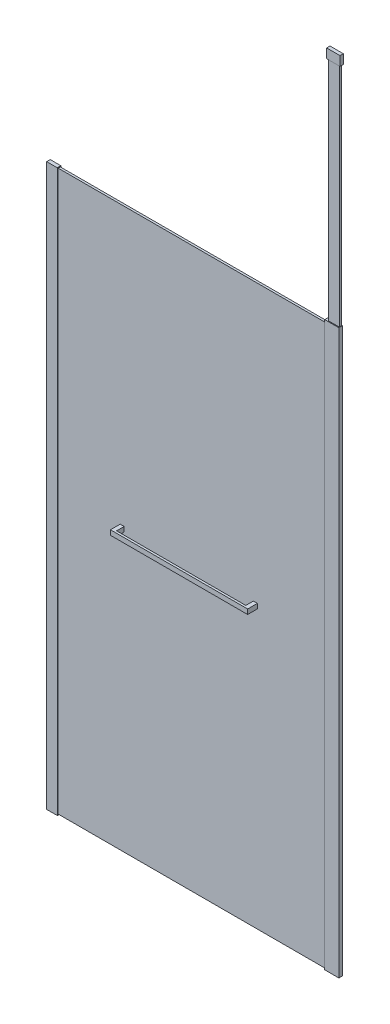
ISO-10303-21;
HEADER;
FILE_DESCRIPTION(('STEP AP214'),'2;1');
FILE_NAME('part.step','',(''),(''),'','','');
FILE_SCHEMA(('AUTOMOTIVE_DESIGN { 1 0 10303 214 1 1 1 1 }'));
ENDSEC;
DATA;
#1=APPLICATION_CONTEXT('core data for automotive mechanical design processes');
#2=APPLICATION_PROTOCOL_DEFINITION('international standard','automotive_design',2000,#1);
#3=PRODUCT_CONTEXT('',#1,'mechanical');
#4=PRODUCT('Part','Part','',(#3));
#5=PRODUCT_RELATED_PRODUCT_CATEGORY('part','',(#4));
#6=PRODUCT_DEFINITION_FORMATION('','',#4);
#7=PRODUCT_DEFINITION_CONTEXT('part definition',#1,'design');
#8=PRODUCT_DEFINITION('design','',#6,#7);
#9=PRODUCT_DEFINITION_SHAPE('','',#8);
#10=(LENGTH_UNIT() NAMED_UNIT(*) SI_UNIT(.MILLI.,.METRE.));
#11=(NAMED_UNIT(*) PLANE_ANGLE_UNIT() SI_UNIT($,.RADIAN.));
#12=(NAMED_UNIT(*) SI_UNIT($,.STERADIAN.) SOLID_ANGLE_UNIT());
#13=UNCERTAINTY_MEASURE_WITH_UNIT(LENGTH_MEASURE(1.E-05),#10,'distance_accuracy_value','');
#14=(GEOMETRIC_REPRESENTATION_CONTEXT(3) GLOBAL_UNCERTAINTY_ASSIGNED_CONTEXT((#13)) GLOBAL_UNIT_ASSIGNED_CONTEXT((#10,
#11,#12)) REPRESENTATION_CONTEXT('',''));
#15=CARTESIAN_POINT('',(0.,0.,0.));
#16=DIRECTION('',(0.,0.,1.));
#17=DIRECTION('',(1.,0.,0.));
#18=AXIS2_PLACEMENT_3D('',#15,#16,#17);
#19=CARTESIAN_POINT('',(287.5,1062.,-21.4));
#20=DIRECTION('',(1.,0.,0.));
#21=DIRECTION('',(0.,0.,-1.));
#22=AXIS2_PLACEMENT_3D('',#19,#20,#21);
#23=PLANE('',#22);
#24=DIRECTION('',(0.,1.,0.));
#25=VECTOR('',#24,1.);
#26=CARTESIAN_POINT('',(287.5,1062.,25.1));
#27=LINE('',#26,#25);
#28=CARTESIAN_POINT('',(287.5,1044.,25.1));
#29=VERTEX_POINT('',#28);
#30=CARTESIAN_POINT('',(287.5,1062.,25.1));
#31=VERTEX_POINT('',#30);
#32=EDGE_CURVE('E63',#29,#31,#27,.T.);
#33=ORIENTED_EDGE('',*,*,#32,.F.);
#34=DIRECTION('',(0.,0.,1.));
#35=VECTOR('',#34,1.);
#36=CARTESIAN_POINT('',(287.5,1044.,-21.4));
#37=LINE('',#36,#35);
#38=CARTESIAN_POINT('',(287.5,1044.,-21.4));
#39=VERTEX_POINT('',#38);
#40=EDGE_CURVE('E12',#39,#29,#37,.T.);
#41=ORIENTED_EDGE('',*,*,#40,.F.);
#42=DIRECTION('',(0.,1.,0.));
#43=VECTOR('',#42,1.);
#44=CARTESIAN_POINT('',(287.5,1062.,-21.4));
#45=LINE('',#44,#43);
#46=CARTESIAN_POINT('',(287.5,1062.,-21.4));
#47=VERTEX_POINT('',#46);
#48=EDGE_CURVE('E193',#39,#47,#45,.T.);
#49=ORIENTED_EDGE('',*,*,#48,.T.);
#50=DIRECTION('',(0.,0.,1.));
#51=VECTOR('',#50,1.);
#52=CARTESIAN_POINT('',(287.5,1062.,-21.4));
#53=LINE('',#52,#51);
#54=EDGE_CURVE('E176',#47,#31,#53,.T.);
#55=ORIENTED_EDGE('',*,*,#54,.T.);
#56=EDGE_LOOP('',(#33,#41,#49,#55));
#57=FACE_BOUND('',#56,.T.);
#58=ADVANCED_FACE('F46',(#57),#23,.T.);
#59=CARTESIAN_POINT('',(272.5,1044.,-21.4));
#60=DIRECTION('',(0.,-1.,0.));
#61=DIRECTION('',(0.,0.,-1.));
#62=AXIS2_PLACEMENT_3D('',#59,#60,#61);
#63=PLANE('',#62);
#64=ORIENTED_EDGE('',*,*,#40,.T.);
#65=DIRECTION('',(-1.,0.,0.));
#66=VECTOR('',#65,1.);
#67=CARTESIAN_POINT('',(792.197715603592,1044.,25.1));
#68=LINE('',#67,#66);
#69=CARTESIAN_POINT('',(772.5,1044.,25.1));
#70=VERTEX_POINT('',#69);
#71=EDGE_CURVE('E166',#70,#29,#68,.T.);
#72=ORIENTED_EDGE('',*,*,#71,.F.);
#73=DIRECTION('',(0.,0.,1.));
#74=VECTOR('',#73,1.);
#75=CARTESIAN_POINT('',(772.5,1044.,-21.4));
#76=LINE('',#75,#74);
#77=CARTESIAN_POINT('',(772.5,1044.,-21.4));
#78=VERTEX_POINT('',#77);
#79=EDGE_CURVE('E149',#78,#70,#76,.T.);
#80=ORIENTED_EDGE('',*,*,#79,.F.);
#81=DIRECTION('',(1.,0.,0.));
#82=VECTOR('',#81,1.);
#83=CARTESIAN_POINT('',(772.5,1044.,-21.4));
#84=LINE('',#83,#82);
#85=CARTESIAN_POINT('',(787.5,1044.,-21.4));
#86=VERTEX_POINT('',#85);
#87=EDGE_CURVE('E131',#78,#86,#84,.T.);
#88=ORIENTED_EDGE('',*,*,#87,.T.);
#89=DIRECTION('',(0.,0.,1.));
#90=VECTOR('',#89,1.);
#91=CARTESIAN_POINT('',(787.5,1044.,-21.4));
#92=LINE('',#91,#90);
#93=CARTESIAN_POINT('',(787.5,1044.,33.1));
#94=VERTEX_POINT('',#93);
#95=EDGE_CURVE('E147',#86,#94,#92,.T.);
#96=ORIENTED_EDGE('',*,*,#95,.T.);
#97=DIRECTION('',(1.,0.,0.));
#98=VECTOR('',#97,1.);
#99=CARTESIAN_POINT('',(272.5,1044.,33.1));
#100=LINE('',#99,#98);
#101=CARTESIAN_POINT('',(272.5,1044.,33.1));
#102=VERTEX_POINT('',#101);
#103=EDGE_CURVE('E135',#102,#94,#100,.T.);
#104=ORIENTED_EDGE('',*,*,#103,.F.);
#105=DIRECTION('',(0.,0.,1.));
#106=VECTOR('',#105,1.);
#107=CARTESIAN_POINT('',(272.5,1044.,-21.4));
#108=LINE('',#107,#106);
#109=CARTESIAN_POINT('',(272.5,1044.,-21.4));
#110=VERTEX_POINT('',#109);
#111=EDGE_CURVE('E55',#110,#102,#108,.T.);
#112=ORIENTED_EDGE('',*,*,#111,.F.);
#113=DIRECTION('',(1.,0.,0.));
#114=VECTOR('',#113,1.);
#115=CARTESIAN_POINT('',(272.5,1044.,-21.4));
#116=LINE('',#115,#114);
#117=EDGE_CURVE('E181',#110,#39,#116,.T.);
#118=ORIENTED_EDGE('',*,*,#117,.T.);
#119=EDGE_LOOP('',(#64,#72,#80,#88,#96,#104,#112,#118));
#120=FACE_BOUND('',#119,.T.);
#121=ADVANCED_FACE('F197',(#120),#63,.T.);
#122=CARTESIAN_POINT('',(272.5,1062.,-21.4));
#123=DIRECTION('',(-1.,0.,0.));
#124=DIRECTION('',(0.,0.,1.));
#125=AXIS2_PLACEMENT_3D('',#122,#123,#124);
#126=PLANE('',#125);
#127=ORIENTED_EDGE('',*,*,#111,.T.);
#128=DIRECTION('',(0.,-1.,0.));
#129=VECTOR('',#128,1.);
#130=CARTESIAN_POINT('',(272.5,1062.,33.1));
#131=LINE('',#130,#129);
#132=CARTESIAN_POINT('',(272.5,1062.,33.1));
#133=VERTEX_POINT('',#132);
#134=EDGE_CURVE('E121',#133,#102,#131,.T.);
#135=ORIENTED_EDGE('',*,*,#134,.F.);
#136=DIRECTION('',(0.,0.,1.));
#137=VECTOR('',#136,1.);
#138=CARTESIAN_POINT('',(272.5,1062.,-21.4));
#139=LINE('',#138,#137);
#140=CARTESIAN_POINT('',(272.5,1062.,-21.4));
#141=VERTEX_POINT('',#140);
#142=EDGE_CURVE('E116',#141,#133,#139,.T.);
#143=ORIENTED_EDGE('',*,*,#142,.F.);
#144=DIRECTION('',(0.,-1.,0.));
#145=VECTOR('',#144,1.);
#146=CARTESIAN_POINT('',(272.5,1062.,-21.4));
#147=LINE('',#146,#145);
#148=EDGE_CURVE('E186',#141,#110,#147,.T.);
#149=ORIENTED_EDGE('',*,*,#148,.T.);
#150=EDGE_LOOP('',(#127,#135,#143,#149));
#151=FACE_BOUND('',#150,.T.);
#152=ADVANCED_FACE('F218',(#151),#126,.T.);
#153=CARTESIAN_POINT('',(272.5,1062.,-21.4));
#154=DIRECTION('',(0.,1.,0.));
#155=DIRECTION('',(0.,0.,1.));
#156=AXIS2_PLACEMENT_3D('',#153,#154,#155);
#157=PLANE('',#156);
#158=ORIENTED_EDGE('',*,*,#142,.T.);
#159=DIRECTION('',(-1.,0.,0.));
#160=VECTOR('',#159,1.);
#161=CARTESIAN_POINT('',(272.5,1062.,33.1));
#162=LINE('',#161,#160);
#163=CARTESIAN_POINT('',(787.5,1062.,33.1));
#164=VERTEX_POINT('',#163);
#165=EDGE_CURVE('E109',#164,#133,#162,.T.);
#166=ORIENTED_EDGE('',*,*,#165,.F.);
#167=DIRECTION('',(0.,0.,1.));
#168=VECTOR('',#167,1.);
#169=CARTESIAN_POINT('',(787.5,1062.,-21.4));
#170=LINE('',#169,#168);
#171=CARTESIAN_POINT('',(787.5,1062.,-21.4));
#172=VERTEX_POINT('',#171);
#173=EDGE_CURVE('E113',#172,#164,#170,.T.);
#174=ORIENTED_EDGE('',*,*,#173,.F.);
#175=DIRECTION('',(-1.,0.,0.));
#176=VECTOR('',#175,1.);
#177=CARTESIAN_POINT('',(772.5,1062.,-21.4));
#178=LINE('',#177,#176);
#179=CARTESIAN_POINT('',(772.5,1062.,-21.4));
#180=VERTEX_POINT('',#179);
#181=EDGE_CURVE('E138',#172,#180,#178,.T.);
#182=ORIENTED_EDGE('',*,*,#181,.T.);
#183=DIRECTION('',(0.,0.,1.));
#184=VECTOR('',#183,1.);
#185=CARTESIAN_POINT('',(772.5,1062.,-21.4));
#186=LINE('',#185,#184);
#187=CARTESIAN_POINT('',(772.5,1062.,25.1));
#188=VERTEX_POINT('',#187);
#189=EDGE_CURVE('E130',#180,#188,#186,.T.);
#190=ORIENTED_EDGE('',*,*,#189,.T.);
#191=DIRECTION('',(-1.,0.,0.));
#192=VECTOR('',#191,1.);
#193=CARTESIAN_POINT('',(792.197715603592,1062.,25.1));
#194=LINE('',#193,#192);
#195=EDGE_CURVE('E163',#188,#31,#194,.T.);
#196=ORIENTED_EDGE('',*,*,#195,.T.);
#197=ORIENTED_EDGE('',*,*,#54,.F.);
#198=DIRECTION('',(-1.,0.,0.));
#199=VECTOR('',#198,1.);
#200=CARTESIAN_POINT('',(272.5,1062.,-21.4));
#201=LINE('',#200,#199);
#202=EDGE_CURVE('E190',#47,#141,#201,.T.);
#203=ORIENTED_EDGE('',*,*,#202,.T.);
#204=EDGE_LOOP('',(#158,#166,#174,#182,#190,#196,#197,#203));
#205=FACE_BOUND('',#204,.T.);
#206=ADVANCED_FACE('F111',(#205),#157,.T.);
#207=CARTESIAN_POINT('',(287.5,1044.,-21.4));
#208=DIRECTION('',(0.,0.,1.));
#209=DIRECTION('',(1.,0.,0.));
#210=AXIS2_PLACEMENT_3D('',#207,#208,#209);
#211=PLANE('',#210);
#212=ORIENTED_EDGE('',*,*,#48,.F.);
#213=ORIENTED_EDGE('',*,*,#117,.F.);
#214=ORIENTED_EDGE('',*,*,#148,.F.);
#215=ORIENTED_EDGE('',*,*,#202,.F.);
#216=EDGE_LOOP('',(#212,#213,#214,#215));
#217=FACE_BOUND('',#216,.T.);
#218=ADVANCED_FACE('F225',(#217),#211,.F.);
#219=CARTESIAN_POINT('',(287.5,1044.,33.1));
#220=DIRECTION('',(0.,0.,1.));
#221=DIRECTION('',(1.,0.,0.));
#222=AXIS2_PLACEMENT_3D('',#219,#220,#221);
#223=PLANE('',#222);
#224=ORIENTED_EDGE('',*,*,#103,.T.);
#225=DIRECTION('',(0.,1.,0.));
#226=VECTOR('',#225,1.);
#227=CARTESIAN_POINT('',(787.5,1062.,33.1));
#228=LINE('',#227,#226);
#229=EDGE_CURVE('E127',#94,#164,#228,.T.);
#230=ORIENTED_EDGE('',*,*,#229,.T.);
#231=ORIENTED_EDGE('',*,*,#165,.T.);
#232=ORIENTED_EDGE('',*,*,#134,.T.);
#233=EDGE_LOOP('',(#224,#230,#231,#232));
#234=FACE_BOUND('',#233,.T.);
#235=ADVANCED_FACE('F133',(#234),#223,.T.);
#236=CARTESIAN_POINT('',(792.197715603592,1062.,25.1));
#237=DIRECTION('',(0.,0.,1.));
#238=DIRECTION('',(1.,0.,0.));
#239=AXIS2_PLACEMENT_3D('',#236,#237,#238);
#240=PLANE('',#239);
#241=ORIENTED_EDGE('',*,*,#195,.F.);
#242=DIRECTION('',(0.,-1.,0.));
#243=VECTOR('',#242,1.);
#244=CARTESIAN_POINT('',(772.5,1062.,25.1));
#245=LINE('',#244,#243);
#246=EDGE_CURVE('E49',#188,#70,#245,.T.);
#247=ORIENTED_EDGE('',*,*,#246,.T.);
#248=ORIENTED_EDGE('',*,*,#71,.T.);
#249=ORIENTED_EDGE('',*,*,#32,.T.);
#250=EDGE_LOOP('',(#241,#247,#248,#249));
#251=FACE_BOUND('',#250,.T.);
#252=ADVANCED_FACE('F203',(#251),#240,.F.);
#253=CARTESIAN_POINT('',(772.5,1062.,-21.4));
#254=DIRECTION('',(-1.,0.,0.));
#255=DIRECTION('',(0.,0.,1.));
#256=AXIS2_PLACEMENT_3D('',#253,#254,#255);
#257=PLANE('',#256);
#258=ORIENTED_EDGE('',*,*,#246,.F.);
#259=ORIENTED_EDGE('',*,*,#189,.F.);
#260=DIRECTION('',(0.,-1.,0.));
#261=VECTOR('',#260,1.);
#262=CARTESIAN_POINT('',(772.5,1062.,-21.4));
#263=LINE('',#262,#261);
#264=EDGE_CURVE('E142',#180,#78,#263,.T.);
#265=ORIENTED_EDGE('',*,*,#264,.T.);
#266=ORIENTED_EDGE('',*,*,#79,.T.);
#267=EDGE_LOOP('',(#258,#259,#265,#266));
#268=FACE_BOUND('',#267,.T.);
#269=ADVANCED_FACE('F204',(#268),#257,.T.);
#270=CARTESIAN_POINT('',(787.5,1062.,-21.4));
#271=DIRECTION('',(1.,0.,0.));
#272=DIRECTION('',(0.,0.,-1.));
#273=AXIS2_PLACEMENT_3D('',#270,#271,#272);
#274=PLANE('',#273);
#275=ORIENTED_EDGE('',*,*,#173,.T.);
#276=ORIENTED_EDGE('',*,*,#229,.F.);
#277=ORIENTED_EDGE('',*,*,#95,.F.);
#278=DIRECTION('',(0.,1.,0.));
#279=VECTOR('',#278,1.);
#280=CARTESIAN_POINT('',(787.5,1062.,-21.4));
#281=LINE('',#280,#279);
#282=EDGE_CURVE('E129',#86,#172,#281,.T.);
#283=ORIENTED_EDGE('',*,*,#282,.T.);
#284=EDGE_LOOP('',(#275,#276,#277,#283));
#285=FACE_BOUND('',#284,.T.);
#286=ADVANCED_FACE('F126',(#285),#274,.T.);
#287=CARTESIAN_POINT('',(787.5,1044.,-21.4));
#288=DIRECTION('',(0.,0.,1.));
#289=DIRECTION('',(1.,0.,0.));
#290=AXIS2_PLACEMENT_3D('',#287,#288,#289);
#291=PLANE('',#290);
#292=ORIENTED_EDGE('',*,*,#282,.F.);
#293=ORIENTED_EDGE('',*,*,#87,.F.);
#294=ORIENTED_EDGE('',*,*,#264,.F.);
#295=ORIENTED_EDGE('',*,*,#181,.F.);
#296=EDGE_LOOP('',(#292,#293,#294,#295));
#297=FACE_BOUND('',#296,.T.);
#298=ADVANCED_FACE('F200',(#297),#291,.F.);
#299=CLOSED_SHELL('',(#58,#121,#152,#206,#218,#235,#252,#269,#286,#298));
#300=MANIFOLD_SOLID_BREP('B2',#299);
#301=CARTESIAN_POINT('',(1049.9,3000.,-1.15000000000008));
#302=DIRECTION('',(1.,0.,0.));
#303=DIRECTION('',(0.,1.,0.));
#304=AXIS2_PLACEMENT_3D('',#301,#302,#303);
#305=PLANE('',#304);
#306=DIRECTION('',(0.,0.,1.));
#307=VECTOR('',#306,1.);
#308=CARTESIAN_POINT('',(1049.9,2965.,-1.15000000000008));
#309=LINE('',#308,#307);
#310=CARTESIAN_POINT('',(1049.9,2965.,-13.6500000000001));
#311=VERTEX_POINT('',#310);
#312=CARTESIAN_POINT('',(1049.9,2965.,-1.15000000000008));
#313=VERTEX_POINT('',#312);
#314=EDGE_CURVE('E406',#311,#313,#309,.T.);
#315=ORIENTED_EDGE('',*,*,#314,.T.);
#316=DIRECTION('',(0.,-1.,0.));
#317=VECTOR('',#316,1.);
#318=CARTESIAN_POINT('',(1049.9,3000.,-1.15000000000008));
#319=LINE('',#318,#317);
#320=CARTESIAN_POINT('',(1049.9,3000.,-1.15000000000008));
#321=VERTEX_POINT('',#320);
#322=EDGE_CURVE('E387',#321,#313,#319,.T.);
#323=ORIENTED_EDGE('',*,*,#322,.F.);
#324=DIRECTION('',(0.,0.,1.));
#325=VECTOR('',#324,1.);
#326=CARTESIAN_POINT('',(1049.9,3000.,-1.15000000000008));
#327=LINE('',#326,#325);
#328=CARTESIAN_POINT('',(1049.9,3000.,-13.6500000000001));
#329=VERTEX_POINT('',#328);
#330=EDGE_CURVE('E394',#329,#321,#327,.T.);
#331=ORIENTED_EDGE('',*,*,#330,.F.);
#332=DIRECTION('',(0.,-1.,0.));
#333=VECTOR('',#332,1.);
#334=CARTESIAN_POINT('',(1049.9,3000.,-13.6500000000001));
#335=LINE('',#334,#333);
#336=EDGE_CURVE('E545',#329,#311,#335,.T.);
#337=ORIENTED_EDGE('',*,*,#336,.T.);
#338=EDGE_LOOP('',(#315,#323,#331,#337));
#339=FACE_BOUND('',#338,.T.);
#340=ADVANCED_FACE('F318',(#339),#305,.F.);
#341=CARTESIAN_POINT('',(1099.9,3000.,-1.15000000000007));
#342=DIRECTION('',(0.,0.,-1.));
#343=DIRECTION('',(-1.,0.,0.));
#344=AXIS2_PLACEMENT_3D('',#341,#342,#343);
#345=PLANE('',#344);
#346=DIRECTION('',(1.,0.,0.));
#347=VECTOR('',#346,1.);
#348=CARTESIAN_POINT('',(1099.9,2965.,-1.15000000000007));
#349=LINE('',#348,#347);
#350=CARTESIAN_POINT('',(1099.9,2965.,-1.15000000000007));
#351=VERTEX_POINT('',#350);
#352=EDGE_CURVE('E543',#313,#351,#349,.T.);
#353=ORIENTED_EDGE('',*,*,#352,.T.);
#354=DIRECTION('',(0.,-1.,0.));
#355=VECTOR('',#354,1.);
#356=CARTESIAN_POINT('',(1099.9,3000.,-1.15000000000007));
#357=LINE('',#356,#355);
#358=CARTESIAN_POINT('',(1099.9,3000.,-1.15000000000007));
#359=VERTEX_POINT('',#358);
#360=EDGE_CURVE('E390',#359,#351,#357,.T.);
#361=ORIENTED_EDGE('',*,*,#360,.F.);
#362=DIRECTION('',(1.,0.,0.));
#363=VECTOR('',#362,1.);
#364=CARTESIAN_POINT('',(1099.9,3000.,-1.15000000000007));
#365=LINE('',#364,#363);
#366=EDGE_CURVE('E383',#321,#359,#365,.T.);
#367=ORIENTED_EDGE('',*,*,#366,.F.);
#368=ORIENTED_EDGE('',*,*,#322,.T.);
#369=EDGE_LOOP('',(#353,#361,#367,#368));
#370=FACE_BOUND('',#369,.T.);
#371=ADVANCED_FACE('F385',(#370),#345,.F.);
#372=CARTESIAN_POINT('',(1099.9,3000.,-1.15000000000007));
#373=DIRECTION('',(-1.,0.,0.));
#374=DIRECTION('',(0.,-1.,0.));
#375=AXIS2_PLACEMENT_3D('',#372,#373,#374);
#376=PLANE('',#375);
#377=DIRECTION('',(0.,0.,-1.));
#378=VECTOR('',#377,1.);
#379=CARTESIAN_POINT('',(1099.9,2965.,-1.15000000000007));
#380=LINE('',#379,#378);
#381=CARTESIAN_POINT('',(1099.9,2965.,-13.6500000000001));
#382=VERTEX_POINT('',#381);
#383=EDGE_CURVE('E539',#351,#382,#380,.T.);
#384=ORIENTED_EDGE('',*,*,#383,.T.);
#385=DIRECTION('',(0.,-1.,0.));
#386=VECTOR('',#385,1.);
#387=CARTESIAN_POINT('',(1099.9,3000.,-13.6500000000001));
#388=LINE('',#387,#386);
#389=CARTESIAN_POINT('',(1099.9,3000.,-13.6500000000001));
#390=VERTEX_POINT('',#389);
#391=EDGE_CURVE('E410',#390,#382,#388,.T.);
#392=ORIENTED_EDGE('',*,*,#391,.F.);
#393=DIRECTION('',(0.,0.,-1.));
#394=VECTOR('',#393,1.);
#395=CARTESIAN_POINT('',(1099.9,3000.,-1.15000000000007));
#396=LINE('',#395,#394);
#397=EDGE_CURVE('E393',#359,#390,#396,.T.);
#398=ORIENTED_EDGE('',*,*,#397,.F.);
#399=ORIENTED_EDGE('',*,*,#360,.T.);
#400=EDGE_LOOP('',(#384,#392,#398,#399));
#401=FACE_BOUND('',#400,.T.);
#402=ADVANCED_FACE('F460',(#401),#376,.F.);
#403=CARTESIAN_POINT('',(1099.9,3000.,-13.6500000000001));
#404=DIRECTION('',(0.,0.,1.));
#405=DIRECTION('',(1.,0.,0.));
#406=AXIS2_PLACEMENT_3D('',#403,#404,#405);
#407=PLANE('',#406);
#408=DIRECTION('',(-1.,0.,0.));
#409=VECTOR('',#408,1.);
#410=CARTESIAN_POINT('',(1099.9,2965.,-13.6500000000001));
#411=LINE('',#410,#409);
#412=EDGE_CURVE('E403',#382,#311,#411,.T.);
#413=ORIENTED_EDGE('',*,*,#412,.T.);
#414=ORIENTED_EDGE('',*,*,#336,.F.);
#415=DIRECTION('',(-1.,0.,0.));
#416=VECTOR('',#415,1.);
#417=CARTESIAN_POINT('',(1099.9,3000.,-13.6500000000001));
#418=LINE('',#417,#416);
#419=EDGE_CURVE('E399',#390,#329,#418,.T.);
#420=ORIENTED_EDGE('',*,*,#419,.F.);
#421=ORIENTED_EDGE('',*,*,#391,.T.);
#422=EDGE_LOOP('',(#413,#414,#420,#421));
#423=FACE_BOUND('',#422,.T.);
#424=ADVANCED_FACE('F507',(#423),#407,.F.);
#425=CARTESIAN_POINT('',(1049.9,3000.,-13.6500000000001));
#426=DIRECTION('',(0.,1.,0.));
#427=DIRECTION('',(0.,0.,1.));
#428=AXIS2_PLACEMENT_3D('',#425,#426,#427);
#429=PLANE('',#428);
#430=ORIENTED_EDGE('',*,*,#330,.T.);
#431=ORIENTED_EDGE('',*,*,#366,.T.);
#432=ORIENTED_EDGE('',*,*,#397,.T.);
#433=ORIENTED_EDGE('',*,*,#419,.T.);
#434=EDGE_LOOP('',(#430,#431,#432,#433));
#435=FACE_BOUND('',#434,.T.);
#436=ADVANCED_FACE('F397',(#435),#429,.T.);
#437=CARTESIAN_POINT('',(1049.9,2965.,-13.6500000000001));
#438=DIRECTION('',(0.,1.,0.));
#439=DIRECTION('',(0.,0.,1.));
#440=AXIS2_PLACEMENT_3D('',#437,#438,#439);
#441=PLANE('',#440);
#442=DIRECTION('',(0.,0.,1.));
#443=VECTOR('',#442,1.);
#444=CARTESIAN_POINT('',(1094.9,2965.,-11.4000000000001));
#445=LINE('',#444,#443);
#446=CARTESIAN_POINT('',(1094.9,2965.,-11.4000000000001));
#447=VERTEX_POINT('',#446);
#448=CARTESIAN_POINT('',(1094.9,2965.,-3.40000000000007));
#449=VERTEX_POINT('',#448);
#450=EDGE_CURVE('E415',#447,#449,#445,.T.);
#451=ORIENTED_EDGE('',*,*,#450,.F.);
#452=DIRECTION('',(1.,0.,0.));
#453=VECTOR('',#452,1.);
#454=CARTESIAN_POINT('',(1094.9,2965.,-11.4000000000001));
#455=LINE('',#454,#453);
#456=CARTESIAN_POINT('',(1054.9,2965.,-11.4000000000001));
#457=VERTEX_POINT('',#456);
#458=EDGE_CURVE('E408',#457,#447,#455,.T.);
#459=ORIENTED_EDGE('',*,*,#458,.F.);
#460=DIRECTION('',(0.,0.,-1.));
#461=VECTOR('',#460,1.);
#462=CARTESIAN_POINT('',(1054.9,2965.,-11.4000000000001));
#463=LINE('',#462,#461);
#464=CARTESIAN_POINT('',(1054.9,2965.,-3.40000000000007));
#465=VERTEX_POINT('',#464);
#466=EDGE_CURVE('E333',#465,#457,#463,.T.);
#467=ORIENTED_EDGE('',*,*,#466,.F.);
#468=DIRECTION('',(-1.,0.,0.));
#469=VECTOR('',#468,1.);
#470=CARTESIAN_POINT('',(1094.9,2965.,-3.40000000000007));
#471=LINE('',#470,#469);
#472=EDGE_CURVE('E44',#449,#465,#471,.T.);
#473=ORIENTED_EDGE('',*,*,#472,.F.);
#474=EDGE_LOOP('',(#451,#459,#467,#473));
#475=FACE_BOUND('',#474,.T.);
#476=ORIENTED_EDGE('',*,*,#314,.F.);
#477=ORIENTED_EDGE('',*,*,#412,.F.);
#478=ORIENTED_EDGE('',*,*,#383,.F.);
#479=ORIENTED_EDGE('',*,*,#352,.F.);
#480=EDGE_LOOP('',(#476,#477,#478,#479));
#481=FACE_BOUND('',#480,.T.);
#482=ADVANCED_FACE('F490',(#475,#481),#441,.F.);
#483=CARTESIAN_POINT('',(1094.9,2997.,-11.4000000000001));
#484=DIRECTION('',(1.,0.,0.));
#485=DIRECTION('',(0.,0.,-1.));
#486=AXIS2_PLACEMENT_3D('',#483,#484,#485);
#487=PLANE('',#486);
#488=DIRECTION('',(0.,-1.,0.));
#489=VECTOR('',#488,1.);
#490=CARTESIAN_POINT('',(1094.9,2997.,-11.4000000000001));
#491=LINE('',#490,#489);
#492=CARTESIAN_POINT('',(1094.9,2114.,-11.4000000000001));
#493=VERTEX_POINT('',#492);
#494=EDGE_CURVE('E326',#447,#493,#491,.T.);
#495=ORIENTED_EDGE('',*,*,#494,.F.);
#496=ORIENTED_EDGE('',*,*,#450,.T.);
#497=DIRECTION('',(0.,-1.,0.));
#498=VECTOR('',#497,1.);
#499=CARTESIAN_POINT('',(1094.9,2997.,-3.40000000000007));
#500=LINE('',#499,#498);
#501=CARTESIAN_POINT('',(1094.9,2114.,-3.40000000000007));
#502=VERTEX_POINT('',#501);
#503=EDGE_CURVE('E430',#449,#502,#500,.T.);
#504=ORIENTED_EDGE('',*,*,#503,.T.);
#505=DIRECTION('',(0.,0.,1.));
#506=VECTOR('',#505,1.);
#507=CARTESIAN_POINT('',(1094.9,2114.,-11.4000000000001));
#508=LINE('',#507,#506);
#509=EDGE_CURVE('E418',#493,#502,#508,.T.);
#510=ORIENTED_EDGE('',*,*,#509,.F.);
#511=EDGE_LOOP('',(#495,#496,#504,#510));
#512=FACE_BOUND('',#511,.T.);
#513=ADVANCED_FACE('F320',(#512),#487,.T.);
#514=CARTESIAN_POINT('',(1094.9,2997.,-11.4000000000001));
#515=DIRECTION('',(0.,0.,-1.));
#516=DIRECTION('',(-1.,0.,0.));
#517=AXIS2_PLACEMENT_3D('',#514,#515,#516);
#518=PLANE('',#517);
#519=DIRECTION('',(0.,-1.,0.));
#520=VECTOR('',#519,1.);
#521=CARTESIAN_POINT('',(1054.9,2997.,-11.4000000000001));
#522=LINE('',#521,#520);
#523=CARTESIAN_POINT('',(1054.9,2114.,-11.4000000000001));
#524=VERTEX_POINT('',#523);
#525=EDGE_CURVE('E432',#457,#524,#522,.T.);
#526=ORIENTED_EDGE('',*,*,#525,.F.);
#527=ORIENTED_EDGE('',*,*,#458,.T.);
#528=ORIENTED_EDGE('',*,*,#494,.T.);
#529=DIRECTION('',(1.,0.,0.));
#530=VECTOR('',#529,1.);
#531=CARTESIAN_POINT('',(1094.9,2114.,-11.4000000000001));
#532=LINE('',#531,#530);
#533=EDGE_CURVE('E427',#524,#493,#532,.T.);
#534=ORIENTED_EDGE('',*,*,#533,.F.);
#535=EDGE_LOOP('',(#526,#527,#528,#534));
#536=FACE_BOUND('',#535,.T.);
#537=ADVANCED_FACE('F445',(#536),#518,.T.);
#538=CARTESIAN_POINT('',(1054.9,2997.,-11.4000000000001));
#539=DIRECTION('',(-1.,0.,0.));
#540=DIRECTION('',(0.,0.,1.));
#541=AXIS2_PLACEMENT_3D('',#538,#539,#540);
#542=PLANE('',#541);
#543=DIRECTION('',(0.,-1.,0.));
#544=VECTOR('',#543,1.);
#545=CARTESIAN_POINT('',(1054.9,2997.,-3.40000000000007));
#546=LINE('',#545,#544);
#547=CARTESIAN_POINT('',(1054.9,2114.,-3.40000000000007));
#548=VERTEX_POINT('',#547);
#549=EDGE_CURVE('E434',#465,#548,#546,.T.);
#550=ORIENTED_EDGE('',*,*,#549,.F.);
#551=ORIENTED_EDGE('',*,*,#466,.T.);
#552=ORIENTED_EDGE('',*,*,#525,.T.);
#553=DIRECTION('',(0.,0.,-1.));
#554=VECTOR('',#553,1.);
#555=CARTESIAN_POINT('',(1054.9,2114.,-11.4000000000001));
#556=LINE('',#555,#554);
#557=EDGE_CURVE('E424',#548,#524,#556,.T.);
#558=ORIENTED_EDGE('',*,*,#557,.F.);
#559=EDGE_LOOP('',(#550,#551,#552,#558));
#560=FACE_BOUND('',#559,.T.);
#561=ADVANCED_FACE('F447',(#560),#542,.T.);
#562=CARTESIAN_POINT('',(1094.9,2997.,-3.40000000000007));
#563=DIRECTION('',(0.,0.,1.));
#564=DIRECTION('',(1.,0.,0.));
#565=AXIS2_PLACEMENT_3D('',#562,#563,#564);
#566=PLANE('',#565);
#567=ORIENTED_EDGE('',*,*,#503,.F.);
#568=ORIENTED_EDGE('',*,*,#472,.T.);
#569=ORIENTED_EDGE('',*,*,#549,.T.);
#570=DIRECTION('',(-1.,0.,0.));
#571=VECTOR('',#570,1.);
#572=CARTESIAN_POINT('',(1094.9,2114.,-3.40000000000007));
#573=LINE('',#572,#571);
#574=EDGE_CURVE('E421',#502,#548,#573,.T.);
#575=ORIENTED_EDGE('',*,*,#574,.F.);
#576=EDGE_LOOP('',(#567,#568,#569,#575));
#577=FACE_BOUND('',#576,.T.);
#578=ADVANCED_FACE('F439',(#577),#566,.T.);
#579=CARTESIAN_POINT('',(1094.9,2114.,-3.40000000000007));
#580=DIRECTION('',(0.,-1.,0.));
#581=DIRECTION('',(0.,0.,-1.));
#582=AXIS2_PLACEMENT_3D('',#579,#580,#581);
#583=PLANE('',#582);
#584=ORIENTED_EDGE('',*,*,#509,.T.);
#585=ORIENTED_EDGE('',*,*,#574,.T.);
#586=ORIENTED_EDGE('',*,*,#557,.T.);
#587=ORIENTED_EDGE('',*,*,#533,.T.);
#588=EDGE_LOOP('',(#584,#585,#586,#587));
#589=FACE_BOUND('',#588,.T.);
#590=ADVANCED_FACE('F443',(#589),#583,.T.);
#591=CLOSED_SHELL('',(#340,#371,#402,#424,#436,#482,#513,#537,#561,#578,#590));
#592=MANIFOLD_SOLID_BREP('B6',#591);
#593=CARTESIAN_POINT('',(1053.5,2111.,-3.39999999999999));
#594=DIRECTION('',(0.,0.,-1.));
#595=DIRECTION('',(-1.,0.,0.));
#596=AXIS2_PLACEMENT_3D('',#593,#594,#595);
#597=PLANE('',#596);
#598=DIRECTION('',(-1.,0.,0.));
#599=VECTOR('',#598,1.);
#600=CARTESIAN_POINT('',(1053.5,2103.2,-3.39999999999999));
#601=LINE('',#600,#599);
#602=CARTESIAN_POINT('',(1053.5,2103.2,-3.39999999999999));
#603=VERTEX_POINT('',#602);
#604=CARTESIAN_POINT('',(1043.4,2103.2,-3.39999999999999));
#605=VERTEX_POINT('',#604);
#606=EDGE_CURVE('E672',#603,#605,#601,.T.);
#607=ORIENTED_EDGE('',*,*,#606,.F.);
#608=DIRECTION('',(0.,-1.,0.));
#609=VECTOR('',#608,1.);
#610=CARTESIAN_POINT('',(1053.5,2111.,-3.39999999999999));
#611=LINE('',#610,#609);
#612=CARTESIAN_POINT('',(1053.5,3.,-3.39999999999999));
#613=VERTEX_POINT('',#612);
#614=EDGE_CURVE('E695',#603,#613,#611,.T.);
#615=ORIENTED_EDGE('',*,*,#614,.T.);
#616=DIRECTION('',(1.,0.,0.));
#617=VECTOR('',#616,1.);
#618=CARTESIAN_POINT('',(1053.5,3.,-3.39999999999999));
#619=LINE('',#618,#617);
#620=CARTESIAN_POINT('',(1043.4,3.,-3.39999999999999));
#621=VERTEX_POINT('',#620);
#622=EDGE_CURVE('E683',#621,#613,#619,.T.);
#623=ORIENTED_EDGE('',*,*,#622,.F.);
#624=DIRECTION('',(0.,-1.,0.));
#625=VECTOR('',#624,1.);
#626=CARTESIAN_POINT('',(1043.4,2111.,-3.39999999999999));
#627=LINE('',#626,#625);
#628=EDGE_CURVE('E575',#605,#621,#627,.T.);
#629=ORIENTED_EDGE('',*,*,#628,.F.);
#630=EDGE_LOOP('',(#607,#615,#623,#629));
#631=FACE_BOUND('',#630,.T.);
#632=ADVANCED_FACE('F567',(#631),#597,.T.);
#633=CARTESIAN_POINT('',(1043.4,2111.,-3.39999999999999));
#634=DIRECTION('',(-1.,0.,0.));
#635=DIRECTION('',(0.,0.,1.));
#636=AXIS2_PLACEMENT_3D('',#633,#634,#635);
#637=PLANE('',#636);
#638=DIRECTION('',(0.,-1.,0.));
#639=VECTOR('',#638,1.);
#640=CARTESIAN_POINT('',(1043.4,2111.,-14.4));
#641=LINE('',#640,#639);
#642=CARTESIAN_POINT('',(1043.4,2114.,-14.4));
#643=VERTEX_POINT('',#642);
#644=CARTESIAN_POINT('',(1043.4,0.,-14.4));
#645=VERTEX_POINT('',#644);
#646=EDGE_CURVE('E635',#643,#645,#641,.T.);
#647=ORIENTED_EDGE('',*,*,#646,.T.);
#648=DIRECTION('',(0.,0.,-1.));
#649=VECTOR('',#648,1.);
#650=CARTESIAN_POINT('',(1043.4,0.,-0.399999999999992));
#651=LINE('',#650,#649);
#652=CARTESIAN_POINT('',(1043.4,0.,-0.399999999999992));
#653=VERTEX_POINT('',#652);
#654=EDGE_CURVE('E639',#653,#645,#651,.T.);
#655=ORIENTED_EDGE('',*,*,#654,.F.);
#656=DIRECTION('',(0.,-1.,0.));
#657=VECTOR('',#656,1.);
#658=CARTESIAN_POINT('',(1043.4,2111.,-0.399999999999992));
#659=LINE('',#658,#657);
#660=CARTESIAN_POINT('',(1043.4,2114.,-0.399999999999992));
#661=VERTEX_POINT('',#660);
#662=EDGE_CURVE('E690',#661,#653,#659,.T.);
#663=ORIENTED_EDGE('',*,*,#662,.F.);
#664=DIRECTION('',(0.,0.,1.));
#665=VECTOR('',#664,1.);
#666=CARTESIAN_POINT('',(1043.4,2114.,-14.4));
#667=LINE('',#666,#665);
#668=EDGE_CURVE('E641',#643,#661,#667,.T.);
#669=ORIENTED_EDGE('',*,*,#668,.F.);
#670=EDGE_LOOP('',(#647,#655,#663,#669));
#671=FACE_BOUND('',#670,.T.);
#672=DIRECTION('',(0.,0.,1.));
#673=VECTOR('',#672,1.);
#674=CARTESIAN_POINT('',(1043.4,2103.2,-3.34999999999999));
#675=LINE('',#674,#673);
#676=CARTESIAN_POINT('',(1043.4,2103.2,-11.4));
#677=VERTEX_POINT('',#676);
#678=EDGE_CURVE('E666',#677,#605,#675,.T.);
#679=ORIENTED_EDGE('',*,*,#678,.T.);
#680=ORIENTED_EDGE('',*,*,#628,.T.);
#681=DIRECTION('',(0.,0.,-1.));
#682=VECTOR('',#681,1.);
#683=CARTESIAN_POINT('',(1043.4,3.,-0.399999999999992));
#684=LINE('',#683,#682);
#685=CARTESIAN_POINT('',(1043.4,3.,-11.4));
#686=VERTEX_POINT('',#685);
#687=EDGE_CURVE('E660',#621,#686,#684,.T.);
#688=ORIENTED_EDGE('',*,*,#687,.T.);
#689=DIRECTION('',(0.,-1.,0.));
#690=VECTOR('',#689,1.);
#691=CARTESIAN_POINT('',(1043.4,2111.,-11.4));
#692=LINE('',#691,#690);
#693=EDGE_CURVE('E646',#677,#686,#692,.T.);
#694=ORIENTED_EDGE('',*,*,#693,.F.);
#695=EDGE_LOOP('',(#679,#680,#688,#694));
#696=FACE_BOUND('',#695,.T.);
#697=ADVANCED_FACE('F637',(#671,#696),#637,.T.);
#698=CARTESIAN_POINT('',(1043.4,2111.,-0.399999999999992));
#699=DIRECTION('',(0.,0.,1.));
#700=DIRECTION('',(1.,0.,0.));
#701=AXIS2_PLACEMENT_3D('',#698,#699,#700);
#702=PLANE('',#701);
#703=ORIENTED_EDGE('',*,*,#662,.T.);
#704=DIRECTION('',(-1.,0.,0.));
#705=VECTOR('',#704,1.);
#706=CARTESIAN_POINT('',(1043.4,0.,-0.399999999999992));
#707=LINE('',#706,#705);
#708=CARTESIAN_POINT('',(1096.4,0.,-0.399999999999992));
#709=VERTEX_POINT('',#708);
#710=EDGE_CURVE('E659',#709,#653,#707,.T.);
#711=ORIENTED_EDGE('',*,*,#710,.F.);
#712=DIRECTION('',(0.,-1.,0.));
#713=VECTOR('',#712,1.);
#714=CARTESIAN_POINT('',(1096.4,2111.,-0.399999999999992));
#715=LINE('',#714,#713);
#716=CARTESIAN_POINT('',(1096.4,2114.,-0.399999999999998));
#717=VERTEX_POINT('',#716);
#718=EDGE_CURVE('E782',#717,#709,#715,.T.);
#719=ORIENTED_EDGE('',*,*,#718,.F.);
#720=DIRECTION('',(1.,0.,0.));
#721=VECTOR('',#720,1.);
#722=CARTESIAN_POINT('',(1096.4,2114.,-0.399999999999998));
#723=LINE('',#722,#721);
#724=EDGE_CURVE('E680',#661,#717,#723,.T.);
#725=ORIENTED_EDGE('',*,*,#724,.F.);
#726=EDGE_LOOP('',(#703,#711,#719,#725));
#727=FACE_BOUND('',#726,.T.);
#728=ADVANCED_FACE('F723',(#727),#702,.T.);
#729=CARTESIAN_POINT('',(1096.4,2111.,-0.399999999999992));
#730=DIRECTION('',(1.,0.,0.));
#731=DIRECTION('',(0.,0.,-1.));
#732=AXIS2_PLACEMENT_3D('',#729,#730,#731);
#733=PLANE('',#732);
#734=ORIENTED_EDGE('',*,*,#718,.T.);
#735=DIRECTION('',(0.,0.,1.));
#736=VECTOR('',#735,1.);
#737=CARTESIAN_POINT('',(1096.4,0.,-0.399999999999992));
#738=LINE('',#737,#736);
#739=CARTESIAN_POINT('',(1096.4,0.,-14.4));
#740=VERTEX_POINT('',#739);
#741=EDGE_CURVE('E654',#740,#709,#738,.T.);
#742=ORIENTED_EDGE('',*,*,#741,.F.);
#743=DIRECTION('',(0.,-1.,0.));
#744=VECTOR('',#743,1.);
#745=CARTESIAN_POINT('',(1096.4,2111.,-14.4));
#746=LINE('',#745,#744);
#747=CARTESIAN_POINT('',(1096.4,2114.,-14.4));
#748=VERTEX_POINT('',#747);
#749=EDGE_CURVE('E645',#748,#740,#746,.T.);
#750=ORIENTED_EDGE('',*,*,#749,.F.);
#751=DIRECTION('',(0.,0.,-1.));
#752=VECTOR('',#751,1.);
#753=CARTESIAN_POINT('',(1096.4,2114.,-14.4));
#754=LINE('',#753,#752);
#755=EDGE_CURVE('E674',#717,#748,#754,.T.);
#756=ORIENTED_EDGE('',*,*,#755,.F.);
#757=EDGE_LOOP('',(#734,#742,#750,#756));
#758=FACE_BOUND('',#757,.T.);
#759=ADVANCED_FACE('F728',(#758),#733,.T.);
#760=CARTESIAN_POINT('',(1096.4,2111.,-14.4));
#761=DIRECTION('',(0.,0.,-1.));
#762=DIRECTION('',(-1.,0.,0.));
#763=AXIS2_PLACEMENT_3D('',#760,#761,#762);
#764=PLANE('',#763);
#765=ORIENTED_EDGE('',*,*,#749,.T.);
#766=DIRECTION('',(1.,0.,0.));
#767=VECTOR('',#766,1.);
#768=CARTESIAN_POINT('',(1043.4,0.,-14.4));
#769=LINE('',#768,#767);
#770=EDGE_CURVE('E649',#645,#740,#769,.T.);
#771=ORIENTED_EDGE('',*,*,#770,.F.);
#772=ORIENTED_EDGE('',*,*,#646,.F.);
#773=DIRECTION('',(-1.,0.,0.));
#774=VECTOR('',#773,1.);
#775=CARTESIAN_POINT('',(1096.4,2114.,-14.4));
#776=LINE('',#775,#774);
#777=EDGE_CURVE('E677',#748,#643,#776,.T.);
#778=ORIENTED_EDGE('',*,*,#777,.F.);
#779=EDGE_LOOP('',(#765,#771,#772,#778));
#780=FACE_BOUND('',#779,.T.);
#781=ADVANCED_FACE('F650',(#780),#764,.T.);
#782=CARTESIAN_POINT('',(1043.4,2111.,-11.4));
#783=DIRECTION('',(0.,0.,1.));
#784=DIRECTION('',(1.,0.,0.));
#785=AXIS2_PLACEMENT_3D('',#782,#783,#784);
#786=PLANE('',#785);
#787=DIRECTION('',(1.,0.,0.));
#788=VECTOR('',#787,1.);
#789=CARTESIAN_POINT('',(1043.4,2103.2,-11.4));
#790=LINE('',#789,#788);
#791=CARTESIAN_POINT('',(1053.5,2103.2,-11.4));
#792=VERTEX_POINT('',#791);
#793=EDGE_CURVE('E670',#677,#792,#790,.T.);
#794=ORIENTED_EDGE('',*,*,#793,.F.);
#795=ORIENTED_EDGE('',*,*,#693,.T.);
#796=DIRECTION('',(-1.,0.,0.));
#797=VECTOR('',#796,1.);
#798=CARTESIAN_POINT('',(1043.4,3.,-11.4));
#799=LINE('',#798,#797);
#800=CARTESIAN_POINT('',(1053.5,3.,-11.4));
#801=VERTEX_POINT('',#800);
#802=EDGE_CURVE('E687',#801,#686,#799,.T.);
#803=ORIENTED_EDGE('',*,*,#802,.F.);
#804=DIRECTION('',(0.,-1.,0.));
#805=VECTOR('',#804,1.);
#806=CARTESIAN_POINT('',(1053.5,2111.,-11.4));
#807=LINE('',#806,#805);
#808=EDGE_CURVE('E590',#792,#801,#807,.T.);
#809=ORIENTED_EDGE('',*,*,#808,.F.);
#810=EDGE_LOOP('',(#794,#795,#803,#809));
#811=FACE_BOUND('',#810,.T.);
#812=ADVANCED_FACE('F709',(#811),#786,.T.);
#813=CARTESIAN_POINT('',(1053.5,2111.,-11.4));
#814=DIRECTION('',(-1.,0.,0.));
#815=DIRECTION('',(0.,0.,1.));
#816=AXIS2_PLACEMENT_3D('',#813,#814,#815);
#817=PLANE('',#816);
#818=DIRECTION('',(0.,0.,1.));
#819=VECTOR('',#818,1.);
#820=CARTESIAN_POINT('',(1053.5,2103.2,-11.4));
#821=LINE('',#820,#819);
#822=EDGE_CURVE('E316',#792,#603,#821,.T.);
#823=ORIENTED_EDGE('',*,*,#822,.F.);
#824=ORIENTED_EDGE('',*,*,#808,.T.);
#825=DIRECTION('',(0.,0.,-1.));
#826=VECTOR('',#825,1.);
#827=CARTESIAN_POINT('',(1053.5,3.,-11.4));
#828=LINE('',#827,#826);
#829=EDGE_CURVE('E684',#613,#801,#828,.T.);
#830=ORIENTED_EDGE('',*,*,#829,.F.);
#831=ORIENTED_EDGE('',*,*,#614,.F.);
#832=EDGE_LOOP('',(#823,#824,#830,#831));
#833=FACE_BOUND('',#832,.T.);
#834=ADVANCED_FACE('F706',(#833),#817,.T.);
#835=CARTESIAN_POINT('',(1096.4,2114.,-0.399999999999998));
#836=DIRECTION('',(0.,-1.,0.));
#837=DIRECTION('',(0.,0.,-1.));
#838=AXIS2_PLACEMENT_3D('',#835,#836,#837);
#839=PLANE('',#838);
#840=ORIENTED_EDGE('',*,*,#755,.T.);
#841=ORIENTED_EDGE('',*,*,#777,.T.);
#842=ORIENTED_EDGE('',*,*,#668,.T.);
#843=ORIENTED_EDGE('',*,*,#724,.T.);
#844=EDGE_LOOP('',(#840,#841,#842,#843));
#845=FACE_BOUND('',#844,.T.);
#846=ADVANCED_FACE('F708',(#845),#839,.F.);
#847=CARTESIAN_POINT('',(1058.4,2103.2,-3.34999999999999));
#848=DIRECTION('',(0.,-1.,0.));
#849=DIRECTION('',(0.,0.,-1.));
#850=AXIS2_PLACEMENT_3D('',#847,#848,#849);
#851=PLANE('',#850);
#852=ORIENTED_EDGE('',*,*,#822,.T.);
#853=ORIENTED_EDGE('',*,*,#606,.T.);
#854=ORIENTED_EDGE('',*,*,#678,.F.);
#855=ORIENTED_EDGE('',*,*,#793,.T.);
#856=EDGE_LOOP('',(#852,#853,#854,#855));
#857=FACE_BOUND('',#856,.T.);
#858=ADVANCED_FACE('F714',(#857),#851,.T.);
#859=CARTESIAN_POINT('',(1043.4,3.,-14.4));
#860=DIRECTION('',(0.,-1.,0.));
#861=DIRECTION('',(0.,0.,-1.));
#862=AXIS2_PLACEMENT_3D('',#859,#860,#861);
#863=PLANE('',#862);
#864=ORIENTED_EDGE('',*,*,#687,.F.);
#865=ORIENTED_EDGE('',*,*,#622,.T.);
#866=ORIENTED_EDGE('',*,*,#829,.T.);
#867=ORIENTED_EDGE('',*,*,#802,.T.);
#868=EDGE_LOOP('',(#864,#865,#866,#867));
#869=FACE_BOUND('',#868,.T.);
#870=ADVANCED_FACE('F701',(#869),#863,.F.);
#871=CARTESIAN_POINT('',(1043.4,0.,-14.4));
#872=DIRECTION('',(0.,-1.,0.));
#873=DIRECTION('',(0.,0.,-1.));
#874=AXIS2_PLACEMENT_3D('',#871,#872,#873);
#875=PLANE('',#874);
#876=ORIENTED_EDGE('',*,*,#654,.T.);
#877=ORIENTED_EDGE('',*,*,#770,.T.);
#878=ORIENTED_EDGE('',*,*,#741,.T.);
#879=ORIENTED_EDGE('',*,*,#710,.T.);
#880=EDGE_LOOP('',(#876,#877,#878,#879));
#881=FACE_BOUND('',#880,.T.);
#882=ADVANCED_FACE('F657',(#881),#875,.T.);
#883=CLOSED_SHELL('',(#632,#697,#728,#759,#781,#812,#834,#846,#858,#870,#882));
#884=MANIFOLD_SOLID_BREP('B38',#883);
#885=CARTESIAN_POINT('',(6.5,2103.,-3.39999999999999));
#886=DIRECTION('',(-1.,0.,0.));
#887=DIRECTION('',(0.,0.,1.));
#888=AXIS2_PLACEMENT_3D('',#885,#886,#887);
#889=PLANE('',#888);
#890=DIRECTION('',(0.,0.,-1.));
#891=VECTOR('',#890,1.);
#892=CARTESIAN_POINT('',(6.5,3.,-3.39999999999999));
#893=LINE('',#892,#891);
#894=CARTESIAN_POINT('',(6.5,3.,-3.39999999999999));
#895=VERTEX_POINT('',#894);
#896=CARTESIAN_POINT('',(6.5,3.,-11.4));
#897=VERTEX_POINT('',#896);
#898=EDGE_CURVE('E919',#895,#897,#893,.T.);
#899=ORIENTED_EDGE('',*,*,#898,.F.);
#900=DIRECTION('',(0.,-1.,0.));
#901=VECTOR('',#900,1.);
#902=CARTESIAN_POINT('',(6.5,2103.,-3.39999999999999));
#903=LINE('',#902,#901);
#904=CARTESIAN_POINT('',(6.5,2103.,-3.39999999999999));
#905=VERTEX_POINT('',#904);
#906=EDGE_CURVE('E565',#905,#895,#903,.T.);
#907=ORIENTED_EDGE('',*,*,#906,.F.);
#908=DIRECTION('',(0.,0.,-1.));
#909=VECTOR('',#908,1.);
#910=CARTESIAN_POINT('',(6.5,2103.,-3.39999999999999));
#911=LINE('',#910,#909);
#912=CARTESIAN_POINT('',(6.5,2103.,-11.4));
#913=VERTEX_POINT('',#912);
#914=EDGE_CURVE('E913',#905,#913,#911,.T.);
#915=ORIENTED_EDGE('',*,*,#914,.T.);
#916=DIRECTION('',(0.,-1.,0.));
#917=VECTOR('',#916,1.);
#918=CARTESIAN_POINT('',(6.5,2103.,-11.4));
#919=LINE('',#918,#917);
#920=EDGE_CURVE('E858',#913,#897,#919,.T.);
#921=ORIENTED_EDGE('',*,*,#920,.T.);
#922=EDGE_LOOP('',(#899,#907,#915,#921));
#923=FACE_BOUND('',#922,.T.);
#924=ADVANCED_FACE('F855',(#923),#889,.T.);
#925=CARTESIAN_POINT('',(6.5,2103.,-3.39999999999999));
#926=DIRECTION('',(0.,0.,1.));
#927=DIRECTION('',(1.,0.,0.));
#928=AXIS2_PLACEMENT_3D('',#925,#926,#927);
#929=PLANE('',#928);
#930=DIRECTION('',(-1.,0.,0.));
#931=VECTOR('',#930,1.);
#932=CARTESIAN_POINT('',(6.5,3.,-3.39999999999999));
#933=LINE('',#932,#931);
#934=CARTESIAN_POINT('',(1053.5,3.,-3.39999999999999));
#935=VERTEX_POINT('',#934);
#936=EDGE_CURVE('E915',#935,#895,#933,.T.);
#937=ORIENTED_EDGE('',*,*,#936,.F.);
#938=DIRECTION('',(0.,-1.,0.));
#939=VECTOR('',#938,1.);
#940=CARTESIAN_POINT('',(1053.5,2103.,-3.39999999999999));
#941=LINE('',#940,#939);
#942=CARTESIAN_POINT('',(1053.5,2103.,-3.39999999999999));
#943=VERTEX_POINT('',#942);
#944=EDGE_CURVE('E864',#943,#935,#941,.T.);
#945=ORIENTED_EDGE('',*,*,#944,.F.);
#946=DIRECTION('',(-1.,0.,0.));
#947=VECTOR('',#946,1.);
#948=CARTESIAN_POINT('',(6.5,2103.,-3.39999999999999));
#949=LINE('',#948,#947);
#950=EDGE_CURVE('E910',#943,#905,#949,.T.);
#951=ORIENTED_EDGE('',*,*,#950,.T.);
#952=ORIENTED_EDGE('',*,*,#906,.T.);
#953=EDGE_LOOP('',(#937,#945,#951,#952));
#954=FACE_BOUND('',#953,.T.);
#955=ADVANCED_FACE('F929',(#954),#929,.T.);
#956=CARTESIAN_POINT('',(1053.5,2103.,-3.39999999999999));
#957=DIRECTION('',(1.,0.,0.));
#958=DIRECTION('',(0.,0.,-1.));
#959=AXIS2_PLACEMENT_3D('',#956,#957,#958);
#960=PLANE('',#959);
#961=DIRECTION('',(0.,0.,1.));
#962=VECTOR('',#961,1.);
#963=CARTESIAN_POINT('',(1053.5,3.,-3.39999999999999));
#964=LINE('',#963,#962);
#965=CARTESIAN_POINT('',(1053.5,3.,-11.4));
#966=VERTEX_POINT('',#965);
#967=EDGE_CURVE('E905',#966,#935,#964,.T.);
#968=ORIENTED_EDGE('',*,*,#967,.F.);
#969=DIRECTION('',(0.,-1.,0.));
#970=VECTOR('',#969,1.);
#971=CARTESIAN_POINT('',(1053.5,2103.,-11.4));
#972=LINE('',#971,#970);
#973=CARTESIAN_POINT('',(1053.5,2103.,-11.4));
#974=VERTEX_POINT('',#973);
#975=EDGE_CURVE('E900',#974,#966,#972,.T.);
#976=ORIENTED_EDGE('',*,*,#975,.F.);
#977=DIRECTION('',(0.,0.,1.));
#978=VECTOR('',#977,1.);
#979=CARTESIAN_POINT('',(1053.5,2103.,-3.39999999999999));
#980=LINE('',#979,#978);
#981=EDGE_CURVE('E903',#974,#943,#980,.T.);
#982=ORIENTED_EDGE('',*,*,#981,.T.);
#983=ORIENTED_EDGE('',*,*,#944,.T.);
#984=EDGE_LOOP('',(#968,#976,#982,#983));
#985=FACE_BOUND('',#984,.T.);
#986=ADVANCED_FACE('F902',(#985),#960,.T.);
#987=CARTESIAN_POINT('',(6.5,2103.,-11.4));
#988=DIRECTION('',(0.,0.,-1.));
#989=DIRECTION('',(-1.,0.,0.));
#990=AXIS2_PLACEMENT_3D('',#987,#988,#989);
#991=PLANE('',#990);
#992=DIRECTION('',(1.,0.,0.));
#993=VECTOR('',#992,1.);
#994=CARTESIAN_POINT('',(6.5,3.,-11.4));
#995=LINE('',#994,#993);
#996=EDGE_CURVE('E922',#897,#966,#995,.T.);
#997=ORIENTED_EDGE('',*,*,#996,.F.);
#998=ORIENTED_EDGE('',*,*,#920,.F.);
#999=DIRECTION('',(1.,0.,0.));
#1000=VECTOR('',#999,1.);
#1001=CARTESIAN_POINT('',(6.5,2103.,-11.4));
#1002=LINE('',#1001,#1000);
#1003=EDGE_CURVE('E909',#913,#974,#1002,.T.);
#1004=ORIENTED_EDGE('',*,*,#1003,.T.);
#1005=ORIENTED_EDGE('',*,*,#975,.T.);
#1006=EDGE_LOOP('',(#997,#998,#1004,#1005));
#1007=FACE_BOUND('',#1006,.T.);
#1008=ADVANCED_FACE('F912',(#1007),#991,.T.);
#1009=CARTESIAN_POINT('',(6.5,2103.,-11.4));
#1010=DIRECTION('',(0.,-1.,0.));
#1011=DIRECTION('',(0.,0.,-1.));
#1012=AXIS2_PLACEMENT_3D('',#1009,#1010,#1011);
#1013=PLANE('',#1012);
#1014=ORIENTED_EDGE('',*,*,#914,.F.);
#1015=ORIENTED_EDGE('',*,*,#950,.F.);
#1016=ORIENTED_EDGE('',*,*,#981,.F.);
#1017=ORIENTED_EDGE('',*,*,#1003,.F.);
#1018=EDGE_LOOP('',(#1014,#1015,#1016,#1017));
#1019=FACE_BOUND('',#1018,.T.);
#1020=ADVANCED_FACE('F908',(#1019),#1013,.F.);
#1021=CARTESIAN_POINT('',(6.5,3.,-11.4));
#1022=DIRECTION('',(0.,-1.,0.));
#1023=DIRECTION('',(0.,0.,-1.));
#1024=AXIS2_PLACEMENT_3D('',#1021,#1022,#1023);
#1025=PLANE('',#1024);
#1026=ORIENTED_EDGE('',*,*,#898,.T.);
#1027=ORIENTED_EDGE('',*,*,#996,.T.);
#1028=ORIENTED_EDGE('',*,*,#967,.T.);
#1029=ORIENTED_EDGE('',*,*,#936,.T.);
#1030=EDGE_LOOP('',(#1026,#1027,#1028,#1029));
#1031=FACE_BOUND('',#1030,.T.);
#1032=ADVANCED_FACE('F928',(#1031),#1025,.T.);
#1033=CLOSED_SHELL('',(#924,#955,#986,#1008,#1020,#1032));
#1034=MANIFOLD_SOLID_BREP('B310',#1033);
#1035=CARTESIAN_POINT('',(40.,2103.,0.));
#1036=DIRECTION('',(0.,0.,-1.));
#1037=DIRECTION('',(-1.,0.,0.));
#1038=AXIS2_PLACEMENT_3D('',#1035,#1036,#1037);
#1039=PLANE('',#1038);
#1040=DIRECTION('',(0.,-1.,0.));
#1041=VECTOR('',#1040,1.);
#1042=CARTESIAN_POINT('',(0.,2103.,0.));
#1043=LINE('',#1042,#1041);
#1044=CARTESIAN_POINT('',(0.,2106.,0.));
#1045=VERTEX_POINT('',#1044);
#1046=CARTESIAN_POINT('',(0.,0.,0.));
#1047=VERTEX_POINT('',#1046);
#1048=EDGE_CURVE('E1053',#1045,#1047,#1043,.T.);
#1049=ORIENTED_EDGE('',*,*,#1048,.T.);
#1050=DIRECTION('',(-1.,0.,0.));
#1051=VECTOR('',#1050,1.);
#1052=CARTESIAN_POINT('',(0.,0.,0.));
#1053=LINE('',#1052,#1051);
#1054=CARTESIAN_POINT('',(40.,0.,0.));
#1055=VERTEX_POINT('',#1054);
#1056=EDGE_CURVE('E1066',#1055,#1047,#1053,.T.);
#1057=ORIENTED_EDGE('',*,*,#1056,.F.);
#1058=DIRECTION('',(0.,-1.,0.));
#1059=VECTOR('',#1058,1.);
#1060=CARTESIAN_POINT('',(40.,2103.,0.));
#1061=LINE('',#1060,#1059);
#1062=CARTESIAN_POINT('',(40.,2106.,0.));
#1063=VERTEX_POINT('',#1062);
#1064=EDGE_CURVE('E853',#1063,#1055,#1061,.T.);
#1065=ORIENTED_EDGE('',*,*,#1064,.F.);
#1066=DIRECTION('',(1.,0.,0.));
#1067=VECTOR('',#1066,1.);
#1068=CARTESIAN_POINT('',(0.,2106.,0.));
#1069=LINE('',#1068,#1067);
#1070=EDGE_CURVE('E1078',#1045,#1063,#1069,.T.);
#1071=ORIENTED_EDGE('',*,*,#1070,.F.);
#1072=EDGE_LOOP('',(#1049,#1057,#1065,#1071));
#1073=FACE_BOUND('',#1072,.T.);
#1074=ADVANCED_FACE('F979',(#1073),#1039,.F.);
#1075=CARTESIAN_POINT('',(6.5,2103.,-3.39999999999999));
#1076=DIRECTION('',(0.,0.,1.));
#1077=DIRECTION('',(1.,0.,0.));
#1078=AXIS2_PLACEMENT_3D('',#1075,#1076,#1077);
#1079=PLANE('',#1078);
#1080=DIRECTION('',(-1.,0.,0.));
#1081=VECTOR('',#1080,1.);
#1082=CARTESIAN_POINT('',(6.5,3.,-3.39999999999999));
#1083=LINE('',#1082,#1081);
#1084=CARTESIAN_POINT('',(40.,3.,-3.39999999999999));
#1085=VERTEX_POINT('',#1084);
#1086=CARTESIAN_POINT('',(6.5,3.,-3.39999999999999));
#1087=VERTEX_POINT('',#1086);
#1088=EDGE_CURVE('E1086',#1085,#1087,#1083,.T.);
#1089=ORIENTED_EDGE('',*,*,#1088,.T.);
#1090=DIRECTION('',(0.,-1.,0.));
#1091=VECTOR('',#1090,1.);
#1092=CARTESIAN_POINT('',(6.5,2103.,-3.39999999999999));
#1093=LINE('',#1092,#1091);
#1094=CARTESIAN_POINT('',(6.5,2103.,-3.39999999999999));
#1095=VERTEX_POINT('',#1094);
#1096=EDGE_CURVE('E1107',#1095,#1087,#1093,.T.);
#1097=ORIENTED_EDGE('',*,*,#1096,.F.);
#1098=DIRECTION('',(-1.,0.,0.));
#1099=VECTOR('',#1098,1.);
#1100=CARTESIAN_POINT('',(6.5,2103.,-3.39999999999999));
#1101=LINE('',#1100,#1099);
#1102=CARTESIAN_POINT('',(40.,2103.,-3.39999999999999));
#1103=VERTEX_POINT('',#1102);
#1104=EDGE_CURVE('E1095',#1103,#1095,#1101,.T.);
#1105=ORIENTED_EDGE('',*,*,#1104,.F.);
#1106=DIRECTION('',(0.,-1.,0.));
#1107=VECTOR('',#1106,1.);
#1108=CARTESIAN_POINT('',(40.,2103.,-3.39999999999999));
#1109=LINE('',#1108,#1107);
#1110=EDGE_CURVE('E989',#1103,#1085,#1109,.T.);
#1111=ORIENTED_EDGE('',*,*,#1110,.T.);
#1112=EDGE_LOOP('',(#1089,#1097,#1105,#1111));
#1113=FACE_BOUND('',#1112,.T.);
#1114=ADVANCED_FACE('F1149',(#1113),#1079,.F.);
#1115=CARTESIAN_POINT('',(6.5,2103.,-11.4));
#1116=DIRECTION('',(-1.,0.,0.));
#1117=DIRECTION('',(0.,0.,1.));
#1118=AXIS2_PLACEMENT_3D('',#1115,#1116,#1117);
#1119=PLANE('',#1118);
#1120=DIRECTION('',(0.,0.,-1.));
#1121=VECTOR('',#1120,1.);
#1122=CARTESIAN_POINT('',(6.5,3.,-11.4));
#1123=LINE('',#1122,#1121);
#1124=CARTESIAN_POINT('',(6.5,3.,-11.4));
#1125=VERTEX_POINT('',#1124);
#1126=EDGE_CURVE('E1098',#1087,#1125,#1123,.T.);
#1127=ORIENTED_EDGE('',*,*,#1126,.T.);
#1128=DIRECTION('',(0.,-1.,0.));
#1129=VECTOR('',#1128,1.);
#1130=CARTESIAN_POINT('',(6.5,2103.,-11.4));
#1131=LINE('',#1130,#1129);
#1132=CARTESIAN_POINT('',(6.5,2103.,-11.4));
#1133=VERTEX_POINT('',#1132);
#1134=EDGE_CURVE('E997',#1133,#1125,#1131,.T.);
#1135=ORIENTED_EDGE('',*,*,#1134,.F.);
#1136=DIRECTION('',(0.,0.,-1.));
#1137=VECTOR('',#1136,1.);
#1138=CARTESIAN_POINT('',(6.5,2103.,-11.4));
#1139=LINE('',#1138,#1137);
#1140=EDGE_CURVE('E1091',#1095,#1133,#1139,.T.);
#1141=ORIENTED_EDGE('',*,*,#1140,.F.);
#1142=ORIENTED_EDGE('',*,*,#1096,.T.);
#1143=EDGE_LOOP('',(#1127,#1135,#1141,#1142));
#1144=FACE_BOUND('',#1143,.T.);
#1145=ADVANCED_FACE('F1146',(#1144),#1119,.F.);
#1146=CARTESIAN_POINT('',(40.,2103.,-11.4));
#1147=DIRECTION('',(0.,0.,-1.));
#1148=DIRECTION('',(-1.,0.,0.));
#1149=AXIS2_PLACEMENT_3D('',#1146,#1147,#1148);
#1150=PLANE('',#1149);
#1151=DIRECTION('',(1.,0.,0.));
#1152=VECTOR('',#1151,1.);
#1153=CARTESIAN_POINT('',(40.,3.,-11.4));
#1154=LINE('',#1153,#1152);
#1155=CARTESIAN_POINT('',(40.,3.,-11.4));
#1156=VERTEX_POINT('',#1155);
#1157=EDGE_CURVE('E982',#1125,#1156,#1154,.T.);
#1158=ORIENTED_EDGE('',*,*,#1157,.T.);
#1159=DIRECTION('',(0.,-1.,0.));
#1160=VECTOR('',#1159,1.);
#1161=CARTESIAN_POINT('',(40.,2103.,-11.4));
#1162=LINE('',#1161,#1160);
#1163=CARTESIAN_POINT('',(40.,2103.,-11.4));
#1164=VERTEX_POINT('',#1163);
#1165=EDGE_CURVE('E1123',#1164,#1156,#1162,.T.);
#1166=ORIENTED_EDGE('',*,*,#1165,.F.);
#1167=DIRECTION('',(1.,0.,0.));
#1168=VECTOR('',#1167,1.);
#1169=CARTESIAN_POINT('',(40.,2103.,-11.4));
#1170=LINE('',#1169,#1168);
#1171=EDGE_CURVE('E1094',#1133,#1164,#1170,.T.);
#1172=ORIENTED_EDGE('',*,*,#1171,.F.);
#1173=ORIENTED_EDGE('',*,*,#1134,.T.);
#1174=EDGE_LOOP('',(#1158,#1166,#1172,#1173));
#1175=FACE_BOUND('',#1174,.T.);
#1176=ADVANCED_FACE('F1122',(#1175),#1150,.F.);
#1177=CARTESIAN_POINT('',(40.,2103.,-13.3));
#1178=DIRECTION('',(-1.,0.,0.));
#1179=DIRECTION('',(0.,0.,1.));
#1180=AXIS2_PLACEMENT_3D('',#1177,#1178,#1179);
#1181=PLANE('',#1180);
#1182=DIRECTION('',(0.,0.,1.));
#1183=VECTOR('',#1182,1.);
#1184=CARTESIAN_POINT('',(40.,0.,0.));
#1185=LINE('',#1184,#1183);
#1186=CARTESIAN_POINT('',(40.,0.,-13.3));
#1187=VERTEX_POINT('',#1186);
#1188=EDGE_CURVE('E1061',#1187,#1055,#1185,.T.);
#1189=ORIENTED_EDGE('',*,*,#1188,.F.);
#1190=DIRECTION('',(0.,-1.,0.));
#1191=VECTOR('',#1190,1.);
#1192=CARTESIAN_POINT('',(40.,2103.,-13.3));
#1193=LINE('',#1192,#1191);
#1194=CARTESIAN_POINT('',(40.,2106.,-13.3));
#1195=VERTEX_POINT('',#1194);
#1196=EDGE_CURVE('E1052',#1195,#1187,#1193,.T.);
#1197=ORIENTED_EDGE('',*,*,#1196,.F.);
#1198=DIRECTION('',(0.,0.,-1.));
#1199=VECTOR('',#1198,1.);
#1200=CARTESIAN_POINT('',(40.,2106.,-13.3));
#1201=LINE('',#1200,#1199);
#1202=EDGE_CURVE('E1081',#1063,#1195,#1201,.T.);
#1203=ORIENTED_EDGE('',*,*,#1202,.F.);
#1204=ORIENTED_EDGE('',*,*,#1064,.T.);
#1205=EDGE_LOOP('',(#1189,#1197,#1203,#1204));
#1206=FACE_BOUND('',#1205,.T.);
#1207=ORIENTED_EDGE('',*,*,#1165,.T.);
#1208=DIRECTION('',(0.,0.,1.));
#1209=VECTOR('',#1208,1.);
#1210=CARTESIAN_POINT('',(40.,3.,0.));
#1211=LINE('',#1210,#1209);
#1212=EDGE_CURVE('E1067',#1156,#1085,#1211,.T.);
#1213=ORIENTED_EDGE('',*,*,#1212,.T.);
#1214=ORIENTED_EDGE('',*,*,#1110,.F.);
#1215=DIRECTION('',(0.,0.,-1.));
#1216=VECTOR('',#1215,1.);
#1217=CARTESIAN_POINT('',(40.,2103.,-13.3));
#1218=LINE('',#1217,#1216);
#1219=EDGE_CURVE('E1074',#1103,#1164,#1218,.T.);
#1220=ORIENTED_EDGE('',*,*,#1219,.T.);
#1221=EDGE_LOOP('',(#1207,#1213,#1214,#1220));
#1222=FACE_BOUND('',#1221,.T.);
#1223=ADVANCED_FACE('F1126',(#1206,#1222),#1181,.F.);
#1224=CARTESIAN_POINT('',(0.,2103.,-13.3));
#1225=DIRECTION('',(0.,0.,1.));
#1226=DIRECTION('',(1.,0.,0.));
#1227=AXIS2_PLACEMENT_3D('',#1224,#1225,#1226);
#1228=PLANE('',#1227);
#1229=ORIENTED_EDGE('',*,*,#1196,.T.);
#1230=DIRECTION('',(1.,0.,0.));
#1231=VECTOR('',#1230,1.);
#1232=CARTESIAN_POINT('',(0.,0.,-13.3));
#1233=LINE('',#1232,#1231);
#1234=CARTESIAN_POINT('',(0.,0.,-13.3));
#1235=VERTEX_POINT('',#1234);
#1236=EDGE_CURVE('E1056',#1235,#1187,#1233,.T.);
#1237=ORIENTED_EDGE('',*,*,#1236,.F.);
#1238=DIRECTION('',(0.,-1.,0.));
#1239=VECTOR('',#1238,1.);
#1240=CARTESIAN_POINT('',(0.,2103.,-13.3));
#1241=LINE('',#1240,#1239);
#1242=CARTESIAN_POINT('',(0.,2106.,-13.3));
#1243=VERTEX_POINT('',#1242);
#1244=EDGE_CURVE('E1042',#1243,#1235,#1241,.T.);
#1245=ORIENTED_EDGE('',*,*,#1244,.F.);
#1246=DIRECTION('',(-1.,0.,0.));
#1247=VECTOR('',#1246,1.);
#1248=CARTESIAN_POINT('',(0.,2106.,-13.3));
#1249=LINE('',#1248,#1247);
#1250=EDGE_CURVE('E1084',#1195,#1243,#1249,.T.);
#1251=ORIENTED_EDGE('',*,*,#1250,.F.);
#1252=EDGE_LOOP('',(#1229,#1237,#1245,#1251));
#1253=FACE_BOUND('',#1252,.T.);
#1254=ADVANCED_FACE('F1057',(#1253),#1228,.F.);
#1255=CARTESIAN_POINT('',(0.,2103.,0.));
#1256=DIRECTION('',(1.,0.,0.));
#1257=DIRECTION('',(0.,0.,-1.));
#1258=AXIS2_PLACEMENT_3D('',#1255,#1256,#1257);
#1259=PLANE('',#1258);
#1260=ORIENTED_EDGE('',*,*,#1244,.T.);
#1261=DIRECTION('',(0.,0.,-1.));
#1262=VECTOR('',#1261,1.);
#1263=CARTESIAN_POINT('',(0.,0.,0.));
#1264=LINE('',#1263,#1262);
#1265=EDGE_CURVE('E1046',#1047,#1235,#1264,.T.);
#1266=ORIENTED_EDGE('',*,*,#1265,.F.);
#1267=ORIENTED_EDGE('',*,*,#1048,.F.);
#1268=DIRECTION('',(0.,0.,1.));
#1269=VECTOR('',#1268,1.);
#1270=CARTESIAN_POINT('',(0.,2106.,-13.3));
#1271=LINE('',#1270,#1269);
#1272=EDGE_CURVE('E1048',#1243,#1045,#1271,.T.);
#1273=ORIENTED_EDGE('',*,*,#1272,.F.);
#1274=EDGE_LOOP('',(#1260,#1266,#1267,#1273));
#1275=FACE_BOUND('',#1274,.T.);
#1276=ADVANCED_FACE('F1044',(#1275),#1259,.F.);
#1277=CARTESIAN_POINT('',(0.,2103.,0.));
#1278=DIRECTION('',(0.,1.,0.));
#1279=DIRECTION('',(0.,0.,1.));
#1280=AXIS2_PLACEMENT_3D('',#1277,#1278,#1279);
#1281=PLANE('',#1280);
#1282=ORIENTED_EDGE('',*,*,#1219,.F.);
#1283=ORIENTED_EDGE('',*,*,#1104,.T.);
#1284=ORIENTED_EDGE('',*,*,#1140,.T.);
#1285=ORIENTED_EDGE('',*,*,#1171,.T.);
#1286=EDGE_LOOP('',(#1282,#1283,#1284,#1285));
#1287=FACE_BOUND('',#1286,.T.);
#1288=ADVANCED_FACE('F1186',(#1287),#1281,.F.);
#1289=CARTESIAN_POINT('',(0.,2106.,0.));
#1290=DIRECTION('',(0.,1.,0.));
#1291=DIRECTION('',(0.,0.,1.));
#1292=AXIS2_PLACEMENT_3D('',#1289,#1290,#1291);
#1293=PLANE('',#1292);
#1294=ORIENTED_EDGE('',*,*,#1272,.T.);
#1295=ORIENTED_EDGE('',*,*,#1070,.T.);
#1296=ORIENTED_EDGE('',*,*,#1202,.T.);
#1297=ORIENTED_EDGE('',*,*,#1250,.T.);
#1298=EDGE_LOOP('',(#1294,#1295,#1296,#1297));
#1299=FACE_BOUND('',#1298,.T.);
#1300=ADVANCED_FACE('F1137',(#1299),#1293,.T.);
#1301=CARTESIAN_POINT('',(0.,0.,-13.3));
#1302=DIRECTION('',(0.,-1.,0.));
#1303=DIRECTION('',(0.,0.,-1.));
#1304=AXIS2_PLACEMENT_3D('',#1301,#1302,#1303);
#1305=PLANE('',#1304);
#1306=ORIENTED_EDGE('',*,*,#1265,.T.);
#1307=ORIENTED_EDGE('',*,*,#1236,.T.);
#1308=ORIENTED_EDGE('',*,*,#1188,.T.);
#1309=ORIENTED_EDGE('',*,*,#1056,.T.);
#1310=EDGE_LOOP('',(#1306,#1307,#1308,#1309));
#1311=FACE_BOUND('',#1310,.T.);
#1312=ADVANCED_FACE('F1064',(#1311),#1305,.T.);
#1313=CARTESIAN_POINT('',(0.,3.,-13.3));
#1314=DIRECTION('',(0.,-1.,0.));
#1315=DIRECTION('',(0.,0.,-1.));
#1316=AXIS2_PLACEMENT_3D('',#1313,#1314,#1315);
#1317=PLANE('',#1316);
#1318=ORIENTED_EDGE('',*,*,#1157,.F.);
#1319=ORIENTED_EDGE('',*,*,#1126,.F.);
#1320=ORIENTED_EDGE('',*,*,#1088,.F.);
#1321=ORIENTED_EDGE('',*,*,#1212,.F.);
#1322=EDGE_LOOP('',(#1318,#1319,#1320,#1321));
#1323=FACE_BOUND('',#1322,.T.);
#1324=ADVANCED_FACE('F1197',(#1323),#1317,.F.);
#1325=CLOSED_SHELL('',(#1074,#1114,#1145,#1176,#1223,#1254,#1276,#1288,#1300,#1312,#1324));
#1326=MANIFOLD_SOLID_BREP('B559',#1325);
#1327=ADVANCED_BREP_SHAPE_REPRESENTATION('',(#18,#300,#592,#884,#1034,#1326),#14);
#1328=SHAPE_DEFINITION_REPRESENTATION(#9,#1327);
ENDSEC;
END-ISO-10303-21;
